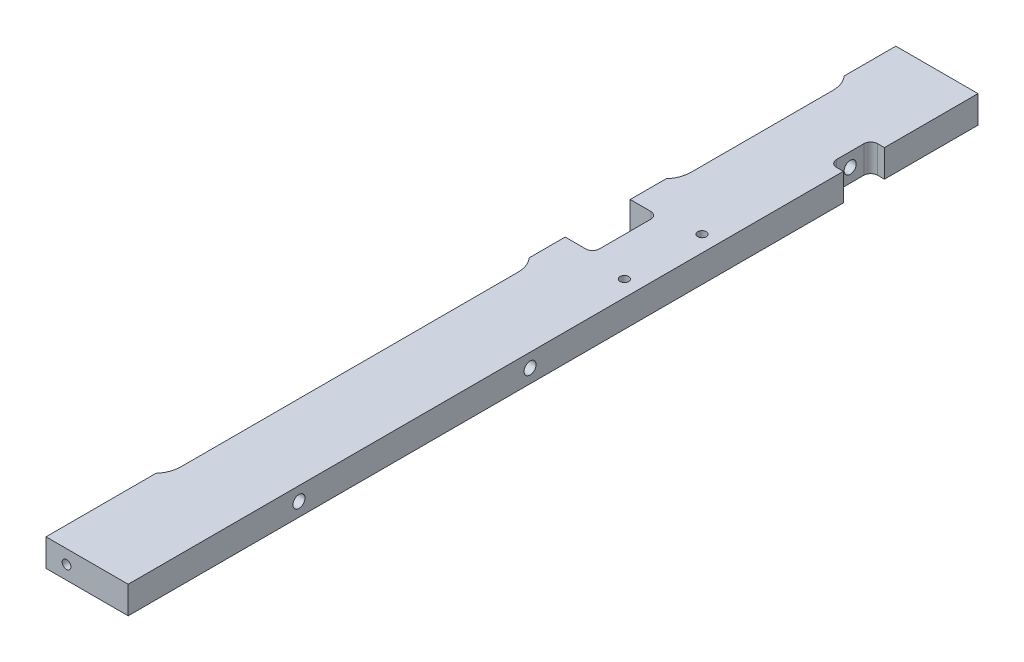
from build123d import *

# Parameters (mm, degrees)
SKETCH1_W                                       = 38.1
SKETCH1_H                                       = 395.4907
BOSS_EXTRUDE1_DEPTH                             = 6.35
F_10_32_TAPPED_HOLE2_D                          = 4.0386
CUT_EXTRUDE2_DEPTH                              = 202.78236654
CBORE_FOR_10_SOCKET_HEAD_CAP_SCREW1_D           = 5.6134
CBORE_FOR_10_SOCKET_HEAD_CAP_SCREW1_CBORE_D     = 9.525
CBORE_FOR_10_SOCKET_HEAD_CAP_SCREW1_CBORE_DEPTH = 24.638
SKETCH16_W                                      = 38.1
SKETCH16_H                                      = 1.4732
CUT_EXTRUDE3_DEPTH                              = 202.78236654
SKETCH17_W                                      = 12.7
SKETCH17_H                                      = 30.1625
CUT_EXTRUDE4_DEPTH                              = 202.78236654
SKETCH22_W                                      = 12.7
SKETCH22_H                                      = 19.05
CUT_EXTRUDE6_DEPTH                              = 6.35
F_10_32_TAPPED_HOLE3_D                          = 4.0386
F_10_32_TAPPED_HOLE3_DEPTH                      = 25.4762
F_10_32_TAPPED_HOLE3_TIP                        = 1.213317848
FILLET2_R                                       = 3.175


with BuildPart() as part:
    # Sketch1 → Boss-Extrude1 (new, symmetric)
    with BuildSketch(Plane(origin=(0, 0, 0), x_dir=(1, 0, 0), z_dir=(0, 1, 0))):
        with Locations((-19.05, 0)):
            Rectangle(SKETCH1_W, SKETCH1_H)
    extrude(amount=BOSS_EXTRUDE1_DEPTH, both=True)

    # 10-32 Tapped Hole2 (through all)
    with Locations(Plane(origin=(0, 6.35, 0), x_dir=(1, 0, 0), z_dir=(0, 1, 0))):
        with Locations((-7.5, 75.84215), (-7.5, 39.84215)):
            Hole(F_10_32_TAPPED_HOLE2_D / 2)

    # Sketch11 → Cut-Extrude2 (cut, through all)
    with BuildSketch(Plane(origin=(0, 6.35, 0), x_dir=(1, 0, 0), z_dir=(0, 1, 0))):
        with BuildLine():
            Line((-38.1, 172.34535), (-38.1, 89.79535))
            ThreePointArc((-38.1, 89.79535), (-35.745237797, 93.705482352), (-34.925, 98.195610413))
            Line((-34.925, 98.195610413), (-34.925, 163.945089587))
            ThreePointArc((-34.925, 163.945089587), (-35.745237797, 168.435217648), (-38.1, 172.34535))
        make_face()
        with BuildLine():
            Line((-38.1, 26.29535), (-38.1, -146.74215))
            ThreePointArc((-38.1, -146.74215), (-35.745237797, -142.832017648), (-34.925, -138.341889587))
            Line((-34.925, -138.341889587), (-34.925, 17.895089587))
            ThreePointArc((-34.925, 17.895089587), (-35.745237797, 22.385217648), (-38.1, 26.29535))
        make_face()
    extrude(amount=-CUT_EXTRUDE2_DEPTH, mode=Mode.SUBTRACT)

    # CBORE for _10 Socket Head Cap Screw1 (through all)
    with Locations(Plane.ZY.offset(34.925)):
        with Locations((118.570427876, 0), (11.401372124, 0), (-143.367072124, 0)):
            CounterBoreHole(CBORE_FOR_10_SOCKET_HEAD_CAP_SCREW1_D / 2, CBORE_FOR_10_SOCKET_HEAD_CAP_SCREW1_CBORE_D / 2, CBORE_FOR_10_SOCKET_HEAD_CAP_SCREW1_CBORE_DEPTH)

    # Sketch16 → Cut-Extrude3 (cut, through all)
    with BuildSketch(Plane(origin=(0, 6.35, 0), x_dir=(1, 0, 0), z_dir=(0, 1, 0))):
        with Locations((-19.05, 197.00875)):
            Rectangle(SKETCH16_W, SKETCH16_H)
    extrude(amount=-CUT_EXTRUDE3_DEPTH, mode=Mode.SUBTRACT)

    # Sketch17 → Cut-Extrude4 (cut, through all)
    with BuildSketch(Plane(origin=(0, 6.35, 0), x_dir=(1, 0, 0), z_dir=(0, 1, 0))):
        with Locations((-31.75, 58.04535)):
            Rectangle(SKETCH17_W, SKETCH17_H)
    extrude(amount=-CUT_EXTRUDE4_DEPTH, mode=Mode.SUBTRACT)

    # Sketch22 → Cut-Extrude6 (cut)
    with BuildSketch(Plane(origin=(0, 6.35, 0), x_dir=(0, -1, 0), z_dir=(1, 0, 0))):
        with Locations((6.35, 143.367072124)):
            Rectangle(SKETCH22_W, SKETCH22_H)
    extrude(amount=-CUT_EXTRUDE6_DEPTH, mode=Mode.SUBTRACT)

    # 10-32 Tapped Hole3
    with Locations(Plane.XY.offset(197.74535)):
        with Locations((-28.575, 0)):
            Hole(F_10_32_TAPPED_HOLE3_D / 2, depth=F_10_32_TAPPED_HOLE3_DEPTH)
            with Locations((0, 0, -(F_10_32_TAPPED_HOLE3_DEPTH + F_10_32_TAPPED_HOLE3_TIP / 2))):  # 118° drill point
                Cone(0, F_10_32_TAPPED_HOLE3_D / 2, F_10_32_TAPPED_HOLE3_TIP, mode=Mode.SUBTRACT)

    # Fillet2
    fillet2_edges = [part.edges().sort_by_distance(p)[0] for p in [
        (-6.35, 0, -133.842072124),
        (-6.35, 0, -152.892072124),
        (-25.4, 0, -73.1266),
        (-25.4, 0, -42.9641),
    ]]
    fillet(fillet2_edges, radius=FILLET2_R)


solid = part.part
